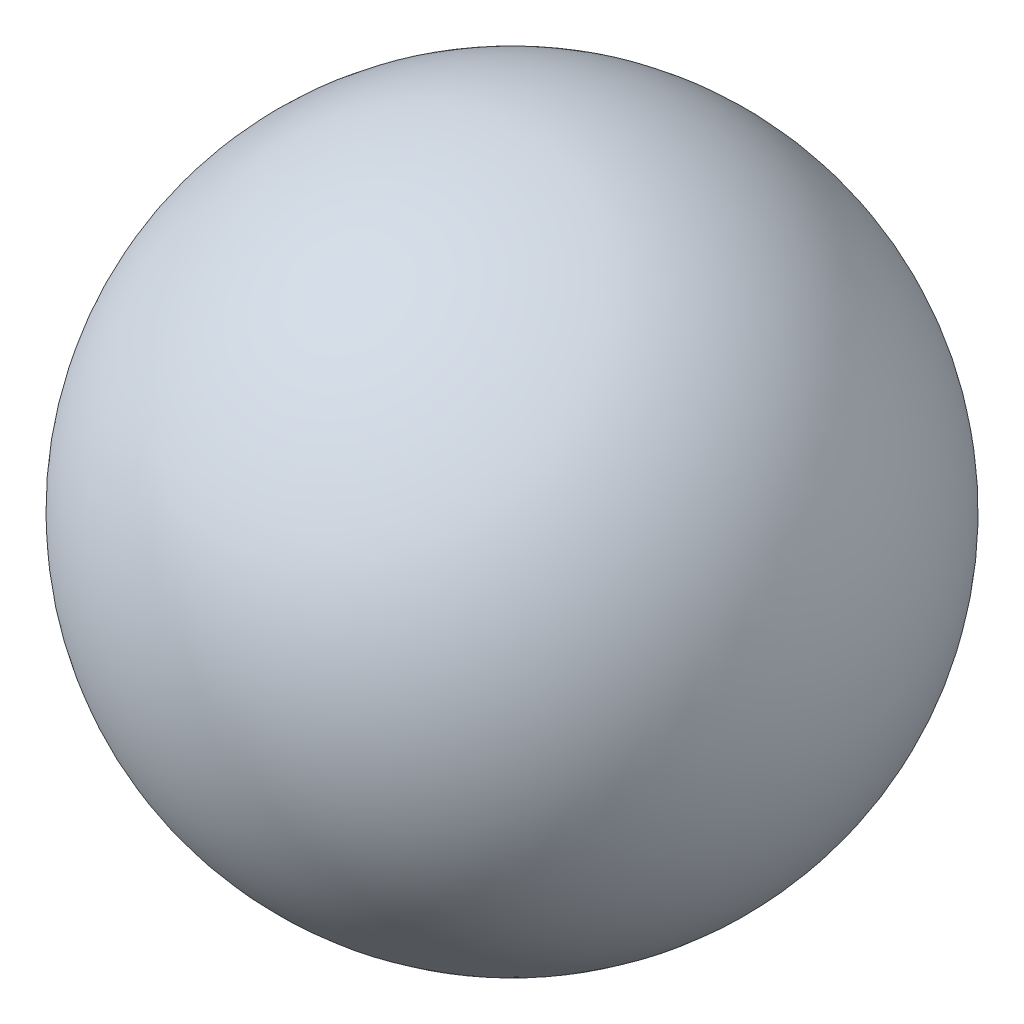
ISO-10303-21;
HEADER;
FILE_DESCRIPTION(('STEP AP214'),'2;1');
FILE_NAME('part.step','',(''),(''),'','','');
FILE_SCHEMA(('AUTOMOTIVE_DESIGN { 1 0 10303 214 1 1 1 1 }'));
ENDSEC;
DATA;
#1=APPLICATION_CONTEXT('core data for automotive mechanical design processes');
#2=APPLICATION_PROTOCOL_DEFINITION('international standard','automotive_design',2000,#1);
#3=PRODUCT_CONTEXT('',#1,'mechanical');
#4=PRODUCT('Part','Part','',(#3));
#5=PRODUCT_RELATED_PRODUCT_CATEGORY('part','',(#4));
#6=PRODUCT_DEFINITION_FORMATION('','',#4);
#7=PRODUCT_DEFINITION_CONTEXT('part definition',#1,'design');
#8=PRODUCT_DEFINITION('design','',#6,#7);
#9=PRODUCT_DEFINITION_SHAPE('','',#8);
#10=(LENGTH_UNIT() NAMED_UNIT(*) SI_UNIT(.MILLI.,.METRE.));
#11=(NAMED_UNIT(*) PLANE_ANGLE_UNIT() SI_UNIT($,.RADIAN.));
#12=(NAMED_UNIT(*) SI_UNIT($,.STERADIAN.) SOLID_ANGLE_UNIT());
#13=UNCERTAINTY_MEASURE_WITH_UNIT(LENGTH_MEASURE(1.E-05),#10,'distance_accuracy_value','');
#14=(GEOMETRIC_REPRESENTATION_CONTEXT(3) GLOBAL_UNCERTAINTY_ASSIGNED_CONTEXT((#13)) GLOBAL_UNIT_ASSIGNED_CONTEXT((#10,
#11,#12)) REPRESENTATION_CONTEXT('',''));
#15=CARTESIAN_POINT('',(0.,0.,0.));
#16=DIRECTION('',(0.,0.,1.));
#17=DIRECTION('',(1.,0.,0.));
#18=AXIS2_PLACEMENT_3D('',#15,#16,#17);
#19=CARTESIAN_POINT('',(0.,0.,0.));
#20=DIRECTION('',(0.,1.,0.));
#21=DIRECTION('',(1.,0.,0.));
#22=AXIS2_PLACEMENT_3D('',#19,#20,#21);
#23=SPHERICAL_SURFACE('',#22,9.5);
#24=CARTESIAN_POINT('',(0.,-9.,0.));
#25=DIRECTION('',(0.,1.,0.));
#26=DIRECTION('',(0.,0.,1.));
#27=AXIS2_PLACEMENT_3D('',#24,#25,#26);
#28=CIRCLE('',#27,3.04138126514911);
#29=CARTESIAN_POINT('',(0.,-9.,3.04138126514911));
#30=VERTEX_POINT('',#29);
#31=EDGE_CURVE('E11',#30,#30,#28,.T.);
#32=ORIENTED_EDGE('',*,*,#31,.T.);
#33=EDGE_LOOP('',(#32));
#34=FACE_BOUND('',#33,.T.);
#35=ADVANCED_FACE('F34',(#34),#23,.T.);
#36=CARTESIAN_POINT('',(5.37130963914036,-9.,-4.22236640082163));
#37=DIRECTION('',(0.,1.,0.));
#38=DIRECTION('',(0.,0.,1.));
#39=AXIS2_PLACEMENT_3D('',#36,#37,#38);
#40=PLANE('',#39);
#41=CARTESIAN_POINT('',(0.,-9.,0.));
#42=DIRECTION('',(0.,-1.,0.));
#43=DIRECTION('',(0.,0.,-1.));
#44=AXIS2_PLACEMENT_3D('',#41,#42,#43);
#45=CIRCLE('',#44,1.64999999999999);
#46=CARTESIAN_POINT('',(0.,-9.,-1.64999999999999));
#47=VERTEX_POINT('',#46);
#48=EDGE_CURVE('E52',#47,#47,#45,.T.);
#49=ORIENTED_EDGE('',*,*,#48,.F.);
#50=EDGE_LOOP('',(#49));
#51=FACE_BOUND('',#50,.T.);
#52=ORIENTED_EDGE('',*,*,#31,.F.);
#53=EDGE_LOOP('',(#52));
#54=FACE_BOUND('',#53,.T.);
#55=ADVANCED_FACE('F47',(#51,#54),#40,.F.);
#56=CARTESIAN_POINT('',(0.,1.,0.));
#57=DIRECTION('',(0.,-1.,0.));
#58=DIRECTION('',(0.,0.,-1.));
#59=AXIS2_PLACEMENT_3D('',#56,#57,#58);
#60=CONICAL_SURFACE('',#59,1.65,1.02974425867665);
#61=CARTESIAN_POINT('',(0.,1.99142002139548,0.));
#62=VERTEX_POINT('',#61);
#63=VERTEX_LOOP('',#62);
#64=FACE_BOUND('',#63,.T.);
#65=CARTESIAN_POINT('',(0.,1.,0.));
#66=DIRECTION('',(0.,-1.,0.));
#67=DIRECTION('',(0.,0.,-1.));
#68=AXIS2_PLACEMENT_3D('',#65,#66,#67);
#69=CIRCLE('',#68,1.65);
#70=CARTESIAN_POINT('',(0.,1.,-1.65));
#71=VERTEX_POINT('',#70);
#72=EDGE_CURVE('E40',#71,#71,#69,.T.);
#73=ORIENTED_EDGE('',*,*,#72,.T.);
#74=EDGE_LOOP('',(#73));
#75=FACE_BOUND('',#74,.T.);
#76=ADVANCED_FACE('F43',(#64,#75),#60,.F.);
#77=CARTESIAN_POINT('',(0.,-9.,0.));
#78=DIRECTION('',(0.,-1.,0.));
#79=DIRECTION('',(0.,0.,-1.));
#80=AXIS2_PLACEMENT_3D('',#77,#78,#79);
#81=CYLINDRICAL_SURFACE('',#80,1.64999999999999);
#82=ORIENTED_EDGE('',*,*,#72,.F.);
#83=EDGE_LOOP('',(#82));
#84=FACE_BOUND('',#83,.T.);
#85=ORIENTED_EDGE('',*,*,#48,.T.);
#86=EDGE_LOOP('',(#85));
#87=FACE_BOUND('',#86,.T.);
#88=ADVANCED_FACE('F46',(#84,#87),#81,.F.);
#89=CLOSED_SHELL('',(#35,#55,#76,#88));
#90=MANIFOLD_SOLID_BREP('B2',#89);
#91=ADVANCED_BREP_SHAPE_REPRESENTATION('',(#18,#90),#14);
#92=SHAPE_DEFINITION_REPRESENTATION(#9,#91);
ENDSEC;
END-ISO-10303-21;
